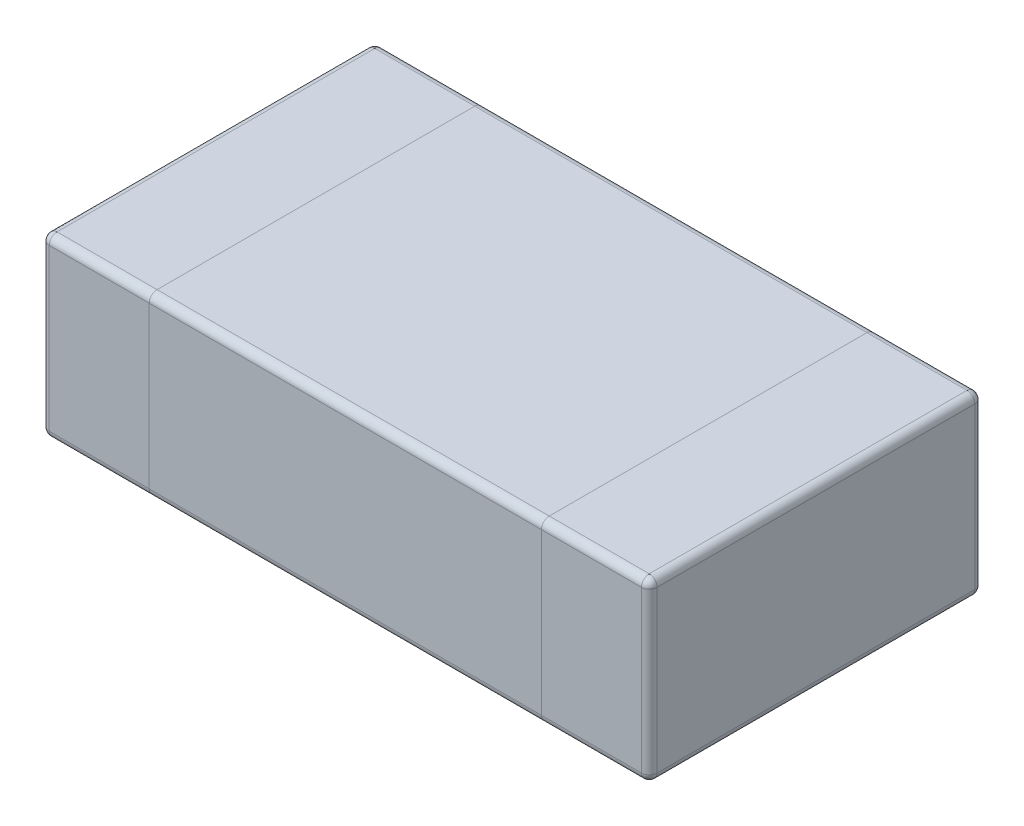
from build123d import *

# Parameters (mm, degrees)
BOSS_EXTRUDE1_DEPTH = 0.225
FILLET2_R           = 0.02


with BuildPart() as part:
    # Sketch1 → Boss-Extrude1 (new, symmetric)
    with BuildSketch(Plane(origin=(0, 0, 0), x_dir=(1, 0, 0), z_dir=(0, 1, 0))):
        with BuildLine():
            Line((-0.755, -0.425), (0.755, -0.425))
            ThreePointArc((0.755, -0.425), (0.769142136, -0.419142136), (0.775, -0.405))
            Line((0.775, -0.405), (0.775, 0.405))
            ThreePointArc((0.775, 0.405), (0.769142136, 0.419142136), (0.755, 0.425))
            Line((0.755, 0.425), (-0.755, 0.425))
            ThreePointArc((-0.755, 0.425), (-0.769142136, 0.419142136), (-0.775, 0.405))
            Line((-0.775, 0.405), (-0.775, -0.405))
            ThreePointArc((-0.775, -0.405), (-0.769142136, -0.419142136), (-0.755, -0.425))
        make_face()
    extrude(amount=BOSS_EXTRUDE1_DEPTH, both=True)

    # Fillet2
    fillet2_edges = [part.edges().sort_by_distance(p)[0] for p in [
        (0.769142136, 0.225, 0.419142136),
        (0, -0.225, 0.425),
        (-0.769142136, -0.225, 0.419142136),
        (0.775, 0.225, 0),
        (0.769142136, 0.225, -0.419142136),
        (0, 0.225, -0.425),
        (-0.769142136, 0.225, -0.419142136),
        (-0.775, 0.225, 0),
        (0, 0.225, 0.425),
        (0, 0.225, -0.425),
        (0, 0.225, -0.425),
        (0, 0.225, 0.425),
        (0, -0.225, 0.425),
        (0, -0.225, 0.425),
        (0, -0.225, -0.425),
        (0, -0.225, -0.425),
        (-0.769142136, 0.225, 0.419142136),
        (0, 0.225, 0.425),
        (-0.775, -0.225, 0),
        (-0.769142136, -0.225, -0.419142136),
        (0, -0.225, -0.425),
        (0.769142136, -0.225, -0.419142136),
        (0.775, -0.225, 0),
        (0.769142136, -0.225, 0.419142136),
    ]]
    fillet(fillet2_edges, radius=FILLET2_R)


solid = part.part
